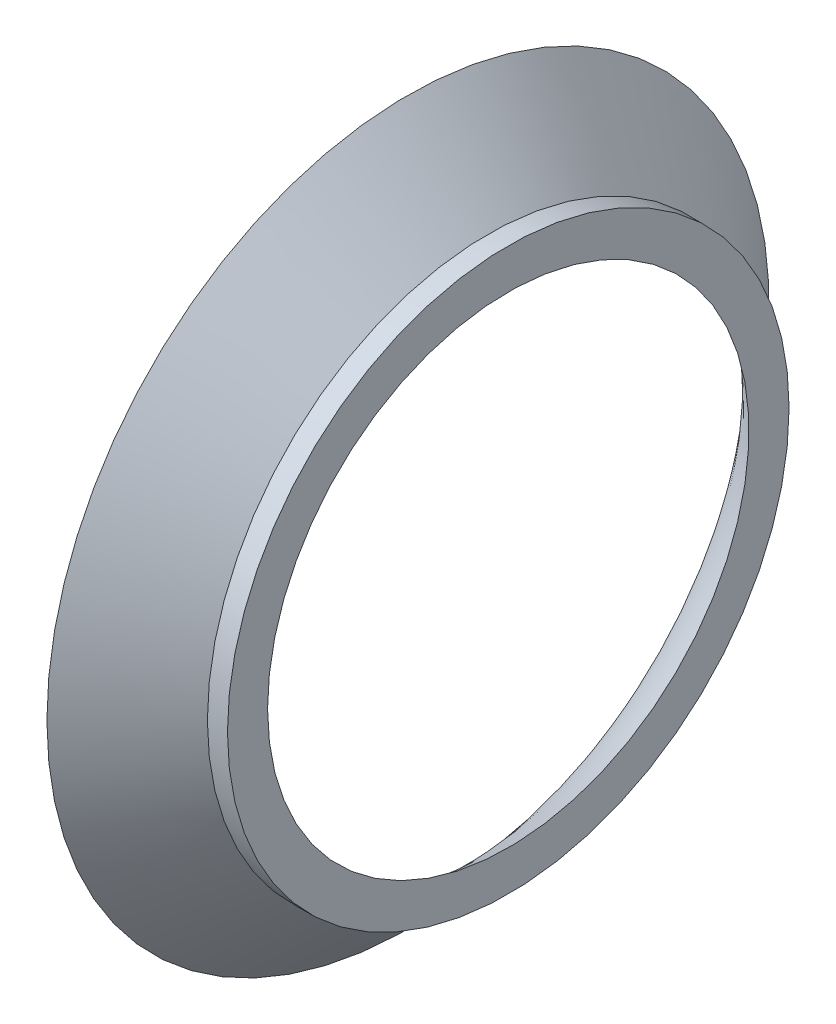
ISO-10303-21;
HEADER;
FILE_DESCRIPTION(('STEP AP214'),'2;1');
FILE_NAME('part.step','',(''),(''),'','','');
FILE_SCHEMA(('AUTOMOTIVE_DESIGN { 1 0 10303 214 1 1 1 1 }'));
ENDSEC;
DATA;
#1=APPLICATION_CONTEXT('core data for automotive mechanical design processes');
#2=APPLICATION_PROTOCOL_DEFINITION('international standard','automotive_design',2000,#1);
#3=PRODUCT_CONTEXT('',#1,'mechanical');
#4=PRODUCT('Part','Part','',(#3));
#5=PRODUCT_RELATED_PRODUCT_CATEGORY('part','',(#4));
#6=PRODUCT_DEFINITION_FORMATION('','',#4);
#7=PRODUCT_DEFINITION_CONTEXT('part definition',#1,'design');
#8=PRODUCT_DEFINITION('design','',#6,#7);
#9=PRODUCT_DEFINITION_SHAPE('','',#8);
#10=(LENGTH_UNIT() NAMED_UNIT(*) SI_UNIT(.MILLI.,.METRE.));
#11=(NAMED_UNIT(*) PLANE_ANGLE_UNIT() SI_UNIT($,.RADIAN.));
#12=(NAMED_UNIT(*) SI_UNIT($,.STERADIAN.) SOLID_ANGLE_UNIT());
#13=UNCERTAINTY_MEASURE_WITH_UNIT(LENGTH_MEASURE(1.E-05),#10,'distance_accuracy_value','');
#14=(GEOMETRIC_REPRESENTATION_CONTEXT(3) GLOBAL_UNCERTAINTY_ASSIGNED_CONTEXT((#13)) GLOBAL_UNIT_ASSIGNED_CONTEXT((#10,
#11,#12)) REPRESENTATION_CONTEXT('',''));
#15=CARTESIAN_POINT('',(0.,0.,0.));
#16=DIRECTION('',(0.,0.,1.));
#17=DIRECTION('',(1.,0.,0.));
#18=AXIS2_PLACEMENT_3D('',#15,#16,#17);
#19=CARTESIAN_POINT('',(-1.2490009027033E-13,-1.94289029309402E-13,7.7715611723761E-13));
#20=DIRECTION('',(-1.,0.,0.));
#21=DIRECTION('',(0.,0.,1.00000000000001));
#22=AXIS2_PLACEMENT_3D('',#19,#20,#21);
#23=CYLINDRICAL_SURFACE('',#22,14.);
#24=CARTESIAN_POINT('',(-1.00000000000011,-1.11022302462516E-13,6.66133814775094E-13));
#25=DIRECTION('',(-1.,0.,0.));
#26=DIRECTION('',(0.,0.,1.00000000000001));
#27=AXIS2_PLACEMENT_3D('',#24,#25,#26);
#28=CIRCLE('',#27,14.);
#29=CARTESIAN_POINT('',(-1.00000000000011,-1.85407245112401E-13,14.000000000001));
#30=VERTEX_POINT('',#29);
#31=EDGE_CURVE('E54',#30,#30,#28,.T.);
#32=CARTESIAN_POINT('',(-1.2490009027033E-13,-1.94289029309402E-13,7.7715611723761E-13));
#33=DIRECTION('',(-1.,0.,0.));
#34=DIRECTION('',(0.,0.,1.00000000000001));
#35=AXIS2_PLACEMENT_3D('',#32,#33,#34);
#36=CIRCLE('',#35,14.);
#37=CARTESIAN_POINT('',(-1.24511512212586E-13,-1.84963155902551E-13,14.000000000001));
#38=VERTEX_POINT('',#37);
#39=EDGE_CURVE('E10',#38,#38,#36,.T.);
#40=CARTESIAN_POINT('',(-1.00000000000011,-1.85407245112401E-13,14.000000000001));
#41=CARTESIAN_POINT('',(-0.989583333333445,-1.85402619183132E-13,14.000000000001));
#42=CARTESIAN_POINT('',(-0.979166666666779,-1.85397993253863E-13,14.000000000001));
#43=CARTESIAN_POINT('',(-0.958333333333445,-1.85388741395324E-13,14.000000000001));
#44=CARTESIAN_POINT('',(-0.947916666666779,-1.85384115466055E-13,14.000000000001));
#45=CARTESIAN_POINT('',(-0.927083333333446,-1.85374863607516E-13,14.000000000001));
#46=CARTESIAN_POINT('',(-0.916666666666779,-1.85370237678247E-13,14.000000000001));
#47=CARTESIAN_POINT('',(-0.895833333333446,-1.85360985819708E-13,14.000000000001));
#48=CARTESIAN_POINT('',(-0.88541666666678,-1.85356359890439E-13,14.000000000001));
#49=CARTESIAN_POINT('',(-0.864583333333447,-1.85347108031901E-13,14.000000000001));
#50=CARTESIAN_POINT('',(-0.85416666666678,-1.85342482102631E-13,14.000000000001));
#51=CARTESIAN_POINT('',(-0.833333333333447,-1.85333230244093E-13,14.000000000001));
#52=CARTESIAN_POINT('',(-0.82291666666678,-1.85328604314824E-13,14.000000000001));
#53=CARTESIAN_POINT('',(-0.802083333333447,-1.85319352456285E-13,14.000000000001));
#54=CARTESIAN_POINT('',(-0.791666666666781,-1.85314726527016E-13,14.000000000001));
#55=CARTESIAN_POINT('',(-0.770833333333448,-1.85305474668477E-13,14.000000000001));
#56=CARTESIAN_POINT('',(-0.760416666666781,-1.85300848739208E-13,14.000000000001));
#57=CARTESIAN_POINT('',(-0.739583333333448,-1.85291596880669E-13,14.000000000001));
#58=CARTESIAN_POINT('',(-0.729166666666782,-1.852869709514E-13,14.000000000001));
#59=CARTESIAN_POINT('',(-0.708333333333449,-1.85277719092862E-13,14.000000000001));
#60=CARTESIAN_POINT('',(-0.697916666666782,-1.85273093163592E-13,14.000000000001));
#61=CARTESIAN_POINT('',(-0.677083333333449,-1.85263841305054E-13,14.000000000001));
#62=CARTESIAN_POINT('',(-0.666666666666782,-1.85259215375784E-13,14.000000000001));
#63=CARTESIAN_POINT('',(-0.645833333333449,-1.85249963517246E-13,14.000000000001));
#64=CARTESIAN_POINT('',(-0.635416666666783,-1.85245337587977E-13,14.000000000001));
#65=CARTESIAN_POINT('',(-0.61458333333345,-1.85236085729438E-13,14.000000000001));
#66=CARTESIAN_POINT('',(-0.604166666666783,-1.85231459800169E-13,14.000000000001));
#67=CARTESIAN_POINT('',(-0.58333333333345,-1.8522220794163E-13,14.000000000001));
#68=CARTESIAN_POINT('',(-0.572916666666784,-1.85217582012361E-13,14.000000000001));
#69=CARTESIAN_POINT('',(-0.552083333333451,-1.85208330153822E-13,14.000000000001));
#70=CARTESIAN_POINT('',(-0.541666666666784,-1.85203704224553E-13,14.000000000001));
#71=CARTESIAN_POINT('',(-0.520833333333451,-1.85194452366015E-13,14.000000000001));
#72=CARTESIAN_POINT('',(-0.510416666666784,-1.85189826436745E-13,14.000000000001));
#73=CARTESIAN_POINT('',(-0.489583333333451,-1.85180574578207E-13,14.000000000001));
#74=CARTESIAN_POINT('',(-0.479166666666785,-1.85175948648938E-13,14.000000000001));
#75=CARTESIAN_POINT('',(-0.458333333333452,-1.85166696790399E-13,14.000000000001));
#76=CARTESIAN_POINT('',(-0.447916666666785,-1.8516207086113E-13,14.000000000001));
#77=CARTESIAN_POINT('',(-0.427083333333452,-1.85152819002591E-13,14.000000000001));
#78=CARTESIAN_POINT('',(-0.416666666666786,-1.85148193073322E-13,14.000000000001));
#79=CARTESIAN_POINT('',(-0.395833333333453,-1.85138941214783E-13,14.000000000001));
#80=CARTESIAN_POINT('',(-0.385416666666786,-1.85134315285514E-13,14.000000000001));
#81=CARTESIAN_POINT('',(-0.364583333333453,-1.85125063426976E-13,14.000000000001));
#82=CARTESIAN_POINT('',(-0.354166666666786,-1.85120437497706E-13,14.000000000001));
#83=CARTESIAN_POINT('',(-0.333333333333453,-1.85111185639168E-13,14.000000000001));
#84=CARTESIAN_POINT('',(-0.322916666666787,-1.85106559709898E-13,14.000000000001));
#85=CARTESIAN_POINT('',(-0.302083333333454,-1.8509730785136E-13,14.000000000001));
#86=CARTESIAN_POINT('',(-0.291666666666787,-1.85092681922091E-13,14.000000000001));
#87=CARTESIAN_POINT('',(-0.270833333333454,-1.85083430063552E-13,14.000000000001));
#88=CARTESIAN_POINT('',(-0.260416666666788,-1.85078804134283E-13,14.000000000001));
#89=CARTESIAN_POINT('',(-0.239583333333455,-1.85069552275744E-13,14.000000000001));
#90=CARTESIAN_POINT('',(-0.229166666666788,-1.85064926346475E-13,14.000000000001));
#91=CARTESIAN_POINT('',(-0.208333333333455,-1.85055674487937E-13,14.000000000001));
#92=CARTESIAN_POINT('',(-0.197916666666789,-1.85051048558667E-13,14.000000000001));
#93=CARTESIAN_POINT('',(-0.177083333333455,-1.85041796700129E-13,14.000000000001));
#94=CARTESIAN_POINT('',(-0.166666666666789,-1.85037170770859E-13,14.000000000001));
#95=CARTESIAN_POINT('',(-0.145833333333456,-1.85027918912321E-13,14.000000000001));
#96=CARTESIAN_POINT('',(-0.135416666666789,-1.85023292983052E-13,14.000000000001));
#97=CARTESIAN_POINT('',(-0.114583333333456,-1.85014041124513E-13,14.000000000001));
#98=CARTESIAN_POINT('',(-0.10416666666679,-1.85009415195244E-13,14.000000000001));
#99=CARTESIAN_POINT('',(-0.0833333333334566,-1.85000163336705E-13,14.000000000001));
#100=CARTESIAN_POINT('',(-0.0729166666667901,-1.84995537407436E-13,14.000000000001));
#101=CARTESIAN_POINT('',(-0.052083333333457,-1.84986285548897E-13,14.000000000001));
#102=CARTESIAN_POINT('',(-0.0416666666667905,-1.84981659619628E-13,14.000000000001));
#103=CARTESIAN_POINT('',(-0.0208333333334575,-1.8497240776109E-13,14.000000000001));
#104=CARTESIAN_POINT('',(-0.0104166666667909,-1.8496778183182E-13,14.000000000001));
#105=CARTESIAN_POINT('',(-1.24403959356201E-13,-1.84963155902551E-13,14.000000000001));
#106=B_SPLINE_CURVE_WITH_KNOTS('',3,(#40,#41,#42,#43,#44,#45,#46,#47,#48,#49,#50,#51,#52,#53,
#54,#55,#56,#57,#58,#59,#60,#61,#62,#63,#64,#65,#66,#67,#68,#69,#70,#71,#72,#73,#74,#75,#76,#77,
#78,#79,#80,#81,#82,#83,#84,#85,#86,#87,#88,#89,#90,#91,#92,#93,#94,#95,#96,#97,#98,#99,#100,
#101,#102,#103,#104,#105),.UNSPECIFIED.,.F.,.F.,(4,2,2,2,2,2,2,2,2,2,2,2,2,2,2,2,2,2,2,2,2,2,2,
2,2,2,2,2,2,2,2,2,4),(0.,0.0312499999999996,0.0624999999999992,0.0937499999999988,
0.124999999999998,0.156249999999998,0.187499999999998,0.218749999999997,0.249999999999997,
0.281249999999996,0.312499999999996,0.343749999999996,0.374999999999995,0.406249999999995,
0.437499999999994,0.468749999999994,0.499999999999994,0.531249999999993,0.562499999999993,
0.593749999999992,0.624999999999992,0.656249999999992,0.687499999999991,0.718749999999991,
0.74999999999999,0.78124999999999,0.81249999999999,0.843749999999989,0.874999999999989,
0.906249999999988,0.937499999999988,0.968749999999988,0.999999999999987),.UNSPECIFIED.);
#107=EDGE_CURVE('BSEAM40',#30,#38,#106,.T.);
#108=ORIENTED_EDGE('',*,*,#31,.F.);
#109=ORIENTED_EDGE('',*,*,#39,.T.);
#110=ORIENTED_EDGE('',*,*,#107,.T.);
#111=ORIENTED_EDGE('',*,*,#107,.F.);
#112=EDGE_LOOP('',(#108,#110,#109,#111));
#113=FACE_BOUND('',#112,.T.);
#114=ADVANCED_FACE('F40',(#113),#23,.T.);
#115=CARTESIAN_POINT('',(-7.63278329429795E-13,11.9999999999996,5.55111512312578E-13));
#116=DIRECTION('',(-1.,0.,0.));
#117=DIRECTION('',(0.,0.,1.00000000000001));
#118=AXIS2_PLACEMENT_3D('',#115,#116,#117);
#119=PLANE('',#118);
#120=ORIENTED_EDGE('',*,*,#39,.F.);
#121=EDGE_LOOP('',(#120));
#122=FACE_BOUND('',#121,.T.);
#123=CARTESIAN_POINT('',(-1.2490009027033E-13,-1.94289029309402E-13,7.7715611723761E-13));
#124=DIRECTION('',(-1.,0.,0.));
#125=DIRECTION('',(0.,0.,1.00000000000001));
#126=AXIS2_PLACEMENT_3D('',#123,#124,#125);
#127=CIRCLE('',#126,12.);
#128=CARTESIAN_POINT('',(-1.28563826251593E-13,-1.86295423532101E-13,12.0000000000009));
#129=VERTEX_POINT('',#128);
#130=EDGE_CURVE('E46',#129,#129,#127,.T.);
#131=ORIENTED_EDGE('',*,*,#130,.T.);
#132=EDGE_LOOP('',(#131));
#133=FACE_BOUND('',#132,.T.);
#134=ADVANCED_FACE('F63',(#122,#133),#119,.F.);
#135=CARTESIAN_POINT('',(8.62595547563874,-3.05311331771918E-13,6.10622663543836E-13));
#136=DIRECTION('',(-1.,0.,0.));
#137=DIRECTION('',(0.,0.,1.00000000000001));
#138=AXIS2_PLACEMENT_3D('',#135,#136,#137);
#139=TOROIDAL_SURFACE('',#138,24.2716295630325,15.);
#140=ORIENTED_EDGE('',*,*,#130,.F.);
#141=EDGE_LOOP('',(#140));
#142=FACE_BOUND('',#141,.T.);
#143=CARTESIAN_POINT('',(-5.00000000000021,-1.94289029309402E-13,4.9960036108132E-13));
#144=DIRECTION('',(-1.,0.,0.));
#145=DIRECTION('',(0.,0.,1.00000000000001));
#146=AXIS2_PLACEMENT_3D('',#143,#144,#145);
#147=CIRCLE('',#146,18.);
#148=CARTESIAN_POINT('',(-5.00000000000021,-1.00808250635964E-13,18.000000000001));
#149=VERTEX_POINT('',#148);
#150=EDGE_CURVE('E50',#149,#149,#147,.T.);
#151=ORIENTED_EDGE('',*,*,#150,.T.);
#152=EDGE_LOOP('',(#151));
#153=FACE_BOUND('',#152,.T.);
#154=ADVANCED_FACE('F67',(#142,#153),#139,.T.);
#155=CARTESIAN_POINT('',(-1.00000000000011,-1.11022302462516E-13,6.66133814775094E-13));
#156=DIRECTION('',(-1.,0.,0.));
#157=DIRECTION('',(0.,0.,1.00000000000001));
#158=AXIS2_PLACEMENT_3D('',#155,#156,#157);
#159=CONICAL_SURFACE('',#158,14.,0.78539816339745);
#160=CARTESIAN_POINT('',(-5.00000000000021,-1.00808250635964E-13,18.000000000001));
#161=CARTESIAN_POINT('',(-4.95833333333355,-1.00817502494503E-13,17.9583333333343));
#162=CARTESIAN_POINT('',(-4.91666666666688,-1.00826754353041E-13,17.9166666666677));
#163=CARTESIAN_POINT('',(-4.83333333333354,-1.00845258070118E-13,17.8333333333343));
#164=CARTESIAN_POINT('',(-4.79166666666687,-1.00854509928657E-13,17.7916666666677));
#165=CARTESIAN_POINT('',(-4.70833333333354,-1.00873013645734E-13,17.7083333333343));
#166=CARTESIAN_POINT('',(-4.66666666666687,-1.00882265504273E-13,17.6666666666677));
#167=CARTESIAN_POINT('',(-4.58333333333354,-1.0090076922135E-13,17.5833333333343));
#168=CARTESIAN_POINT('',(-4.54166666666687,-1.00910021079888E-13,17.5416666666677));
#169=CARTESIAN_POINT('',(-4.45833333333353,-1.00928524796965E-13,17.4583333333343));
#170=CARTESIAN_POINT('',(-4.41666666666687,-1.00937776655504E-13,17.4166666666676));
#171=CARTESIAN_POINT('',(-4.33333333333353,-1.00956280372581E-13,17.3333333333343));
#172=CARTESIAN_POINT('',(-4.29166666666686,-1.00965532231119E-13,17.2916666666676));
#173=CARTESIAN_POINT('',(-4.20833333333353,-1.00984035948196E-13,17.2083333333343));
#174=CARTESIAN_POINT('',(-4.16666666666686,-1.00993287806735E-13,17.1666666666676));
#175=CARTESIAN_POINT('',(-4.08333333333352,-1.01011791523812E-13,17.0833333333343));
#176=CARTESIAN_POINT('',(-4.04166666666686,-1.01021043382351E-13,17.0416666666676));
#177=CARTESIAN_POINT('',(-3.95833333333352,-1.01039547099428E-13,16.9583333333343));
#178=CARTESIAN_POINT('',(-3.91666666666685,-1.01048798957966E-13,16.9166666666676));
#179=CARTESIAN_POINT('',(-3.83333333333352,-1.01067302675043E-13,16.8333333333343));
#180=CARTESIAN_POINT('',(-3.79166666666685,-1.01076554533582E-13,16.7916666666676));
#181=CARTESIAN_POINT('',(-3.70833333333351,-1.01095058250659E-13,16.7083333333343));
#182=CARTESIAN_POINT('',(-3.66666666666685,-1.01104310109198E-13,16.6666666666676));
#183=CARTESIAN_POINT('',(-3.58333333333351,-1.01122813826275E-13,16.5833333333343));
#184=CARTESIAN_POINT('',(-3.54166666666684,-1.01132065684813E-13,16.5416666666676));
#185=CARTESIAN_POINT('',(-3.45833333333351,-1.0115056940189E-13,16.4583333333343));
#186=CARTESIAN_POINT('',(-3.41666666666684,-1.01159821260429E-13,16.4166666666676));
#187=CARTESIAN_POINT('',(-3.3333333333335,-1.01178324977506E-13,16.3333333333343));
#188=CARTESIAN_POINT('',(-3.29166666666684,-1.01187576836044E-13,16.2916666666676));
#189=CARTESIAN_POINT('',(-3.2083333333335,-1.01206080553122E-13,16.2083333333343));
#190=CARTESIAN_POINT('',(-3.16666666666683,-1.0121533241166E-13,16.1666666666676));
#191=CARTESIAN_POINT('',(-3.0833333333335,-1.01233836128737E-13,16.0833333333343));
#192=CARTESIAN_POINT('',(-3.04166666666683,-1.01243087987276E-13,16.0416666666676));
#193=CARTESIAN_POINT('',(-2.9583333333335,-1.01261591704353E-13,15.9583333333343));
#194=CARTESIAN_POINT('',(-2.91666666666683,-1.01270843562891E-13,15.9166666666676));
#195=CARTESIAN_POINT('',(-2.83333333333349,-1.01289347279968E-13,15.8333333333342));
#196=CARTESIAN_POINT('',(-2.79166666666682,-1.01298599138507E-13,15.7916666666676));
#197=CARTESIAN_POINT('',(-2.70833333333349,-1.01317102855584E-13,15.7083333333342));
#198=CARTESIAN_POINT('',(-2.66666666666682,-1.01326354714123E-13,15.6666666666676));
#199=CARTESIAN_POINT('',(-2.58333333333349,-1.013448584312E-13,15.5833333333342));
#200=CARTESIAN_POINT('',(-2.54166666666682,-1.01354110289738E-13,15.5416666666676));
#201=CARTESIAN_POINT('',(-2.45833333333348,-1.01372614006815E-13,15.4583333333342));
#202=CARTESIAN_POINT('',(-2.41666666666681,-1.01381865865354E-13,15.4166666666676));
#203=CARTESIAN_POINT('',(-2.33333333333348,-1.01400369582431E-13,15.3333333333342));
#204=CARTESIAN_POINT('',(-2.29166666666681,-1.0140962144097E-13,15.2916666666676));
#205=CARTESIAN_POINT('',(-2.20833333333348,-1.01428125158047E-13,15.2083333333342));
#206=CARTESIAN_POINT('',(-2.16666666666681,-1.01437377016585E-13,15.1666666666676));
#207=CARTESIAN_POINT('',(-2.08333333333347,-1.01455880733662E-13,15.0833333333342));
#208=CARTESIAN_POINT('',(-2.04166666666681,-1.01465132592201E-13,15.0416666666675));
#209=CARTESIAN_POINT('',(-1.95833333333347,-1.01483636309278E-13,14.9583333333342));
#210=CARTESIAN_POINT('',(-1.9166666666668,-1.01492888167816E-13,14.9166666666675));
#211=CARTESIAN_POINT('',(-1.83333333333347,-1.01511391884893E-13,14.8333333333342));
#212=CARTESIAN_POINT('',(-1.7916666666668,-1.01520643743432E-13,14.7916666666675));
#213=CARTESIAN_POINT('',(-1.70833333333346,-1.01539147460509E-13,14.7083333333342));
#214=CARTESIAN_POINT('',(-1.6666666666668,-1.01548399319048E-13,14.6666666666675));
#215=CARTESIAN_POINT('',(-1.58333333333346,-1.01566903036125E-13,14.5833333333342));
#216=CARTESIAN_POINT('',(-1.54166666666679,-1.01576154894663E-13,14.5416666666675));
#217=CARTESIAN_POINT('',(-1.45833333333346,-1.0159465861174E-13,14.4583333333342));
#218=CARTESIAN_POINT('',(-1.41666666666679,-1.01603910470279E-13,14.4166666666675));
#219=CARTESIAN_POINT('',(-1.33333333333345,-1.01622414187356E-13,14.3333333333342));
#220=CARTESIAN_POINT('',(-1.29166666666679,-1.01631666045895E-13,14.2916666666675));
#221=CARTESIAN_POINT('',(-1.20833333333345,-1.01650169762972E-13,14.2083333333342));
#222=CARTESIAN_POINT('',(-1.16666666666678,-1.0165942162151E-13,14.1666666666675));
#223=CARTESIAN_POINT('',(-1.08333333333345,-1.01677925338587E-13,14.0833333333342));
#224=CARTESIAN_POINT('',(-1.04166666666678,-1.01687177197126E-13,14.0416666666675));
#225=CARTESIAN_POINT('',(-1.00000000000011,-1.01696429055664E-13,14.0000000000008));
#226=B_SPLINE_CURVE_WITH_KNOTS('',3,(#160,#161,#162,#163,#164,#165,#166,#167,#168,#169,#170,
#171,#172,#173,#174,#175,#176,#177,#178,#179,#180,#181,#182,#183,#184,#185,#186,#187,#188,#189,
#190,#191,#192,#193,#194,#195,#196,#197,#198,#199,#200,#201,#202,#203,#204,#205,#206,#207,#208,
#209,#210,#211,#212,#213,#214,#215,#216,#217,#218,#219,#220,#221,#222,#223,#224,#225),
.UNSPECIFIED.,.F.,.F.,(4,2,2,2,2,2,2,2,2,2,2,2,2,2,2,2,2,2,2,2,2,2,2,2,2,2,2,2,2,2,2,2,4),(0.,
0.176776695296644,0.353553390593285,0.530330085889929,0.707106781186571,0.883883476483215,
1.06066017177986,1.2374368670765,1.41421356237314,1.59099025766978,1.76776695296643,
1.94454364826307,2.12132034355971,2.29809703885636,2.474873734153,2.65165042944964,
2.82842712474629,3.00520382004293,3.18198051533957,3.35875721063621,3.53553390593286,
3.7123106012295,3.88908729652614,4.06586399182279,4.24264068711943,4.41941738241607,
4.59619407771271,4.77297077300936,4.949747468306,5.12652416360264,5.30330085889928,
5.48007755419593,5.65685424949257),.UNSPECIFIED.);
#227=EDGE_CURVE('BSEAM60',#149,#30,#226,.T.);
#228=ORIENTED_EDGE('',*,*,#150,.F.);
#229=ORIENTED_EDGE('',*,*,#31,.T.);
#230=ORIENTED_EDGE('',*,*,#227,.T.);
#231=ORIENTED_EDGE('',*,*,#227,.F.);
#232=EDGE_LOOP('',(#228,#230,#229,#231));
#233=FACE_BOUND('',#232,.T.);
#234=ADVANCED_FACE('F60',(#233),#159,.T.);
#235=CLOSED_SHELL('',(#114,#134,#154,#234));
#236=MANIFOLD_SOLID_BREP('B2',#235);
#237=ADVANCED_BREP_SHAPE_REPRESENTATION('',(#18,#236),#14);
#238=SHAPE_DEFINITION_REPRESENTATION(#9,#237);
ENDSEC;
END-ISO-10303-21;
